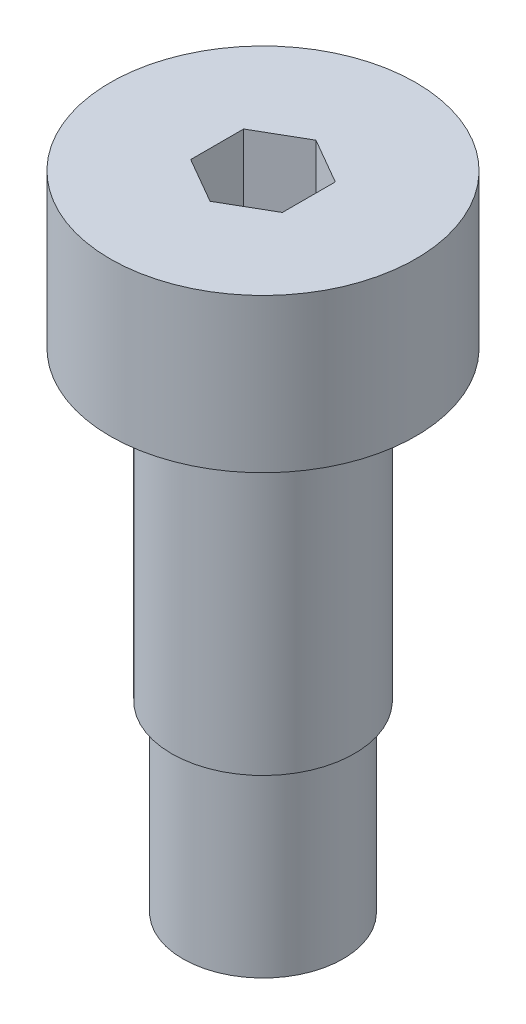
from build123d import *

# Parameters (mm, degrees)
CUT_EXTRUDE1_DEPTH = 2.38125


with BuildPart() as part:
    # Sketch1 → Revolve1 (revolve)
    with BuildSketch(Plane.XY, mode=Mode.PRIVATE) as revolve1_sk:
        Polygon((0, 3.9878), (3.96875, 3.9878), (3.96875, 0), (2.3749, 0), (2.3749, -7.9375), (2.0828, -7.9375), (2.0828, -12.7), (0, -12.7), align=None)
    revolve(revolve1_sk.sketch.rotate(Axis((0, 49.143478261, 0), (0, -1, 0)), 90), axis=Axis((0, 49.143478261, 0), (0, -1, 0)))

    # Sketch2 → Cut-Extrude1 (cut)
    with BuildSketch(Plane(origin=(0, 3.9878, 0), x_dir=(-1, 0, 0), z_dir=(0, 1, 0))):
        Polygon((0, 1.374815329), (-1.190625, 0.687407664), (-1.190625, -0.687407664), (0, -1.374815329), (1.190625, -0.687407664), (1.190625, 0.687407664), align=None)
    extrude(amount=-CUT_EXTRUDE1_DEPTH, mode=Mode.SUBTRACT)


solid = part.part
